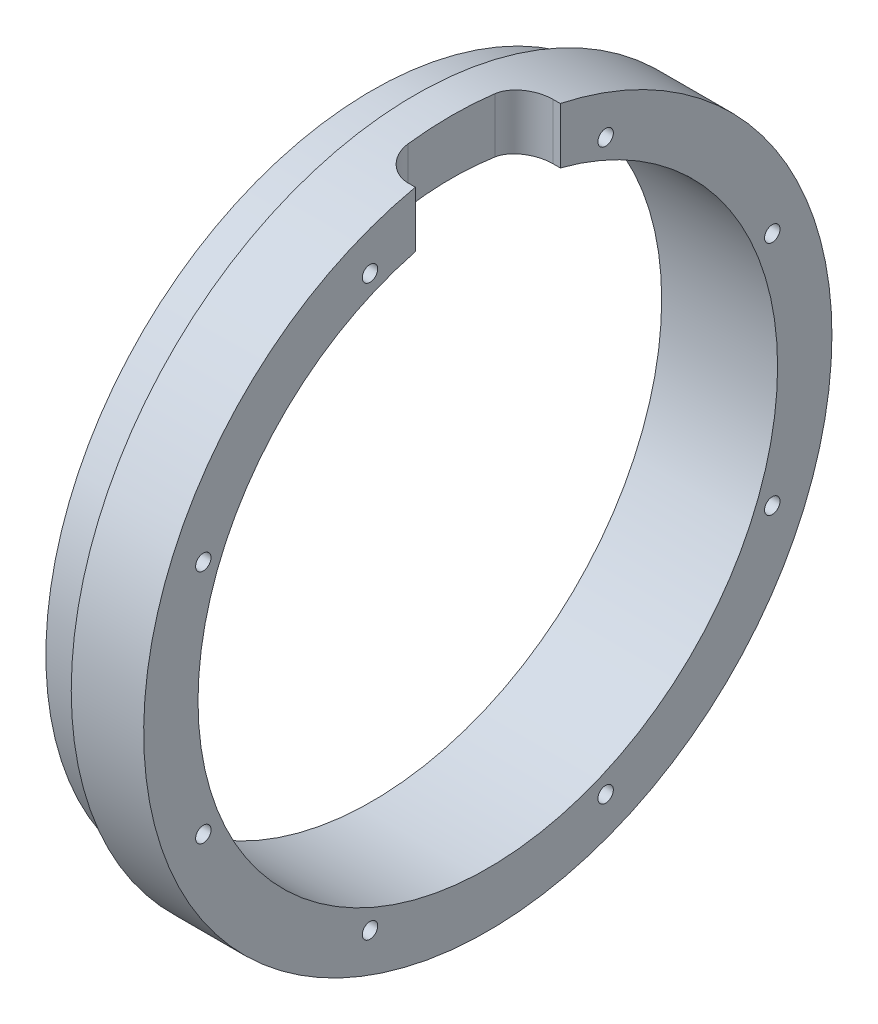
from build123d import *

# Parameters (mm, degrees)
F_6_32_TAPPED_HOLE1_D = 2.7051
CIRPATTERN1_COUNT     = 8
SKETCH4_W             = 6.35
SKETCH4_H             = 25.4
SIDE_WIRE_SLOT_DEPTH  = 87.252543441
FILLET1_R             = 5.08


with BuildPart() as part:
    # Sketch1 → Revolve1 (revolve)
    with BuildSketch(Plane(origin=(0, 0, 0), x_dir=(1, 0, 0), z_dir=(0, 1, 0)), mode=Mode.PRIVATE) as revolve1_sk:
        Polygon((0, -57.15), (0, -60.325), (12.7, -60.325), (12.7, -50.8), (-7.62, -50.8), (-7.62, -57.15), align=None)
    revolve(revolve1_sk.sketch.rotate(Axis((0, 0, 0), (-1, 0, 0)), 180), axis=Axis((0, 0, 0), (-1, 0, 0)))

    # 6-32 Tapped Hole1 (through all)
    with Locations(Plane.ZY.offset(7.62)):
        with Locations((20.655338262, 49.866397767)):
            f_6_32_tapped_hole1 = Hole(F_6_32_TAPPED_HOLE1_D / 2)

    # CirPattern1: 6-32 Tapped Hole1 ×8 about axis
    cirpattern1_axis = Axis((0, 0, 0), (1, 0, 0))
    for i in range(1, CIRPATTERN1_COUNT):
        add(f_6_32_tapped_hole1.rotate(cirpattern1_axis, i * 360 / CIRPATTERN1_COUNT), mode=Mode.SUBTRACT)

    # Sketch4 → side-wire-slot (cut, through all)
    with BuildSketch(Plane(origin=(0, 0, 0), x_dir=(1, 0, 0), z_dir=(0, 1, 0))):
        with Locations((9.525, 0)):
            Rectangle(SKETCH4_W, SKETCH4_H)
    extrude(amount=SIDE_WIRE_SLOT_DEPTH, mode=Mode.SUBTRACT)

    # Fillet1
    fillet1_edges = [part.edges().sort_by_distance(p)[0] for p in [
        (6.35, 54.079948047, -12.7),
        (6.35, 54.079948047, 12.7),
    ]]
    fillet(fillet1_edges, radius=FILLET1_R)


solid = part.part
